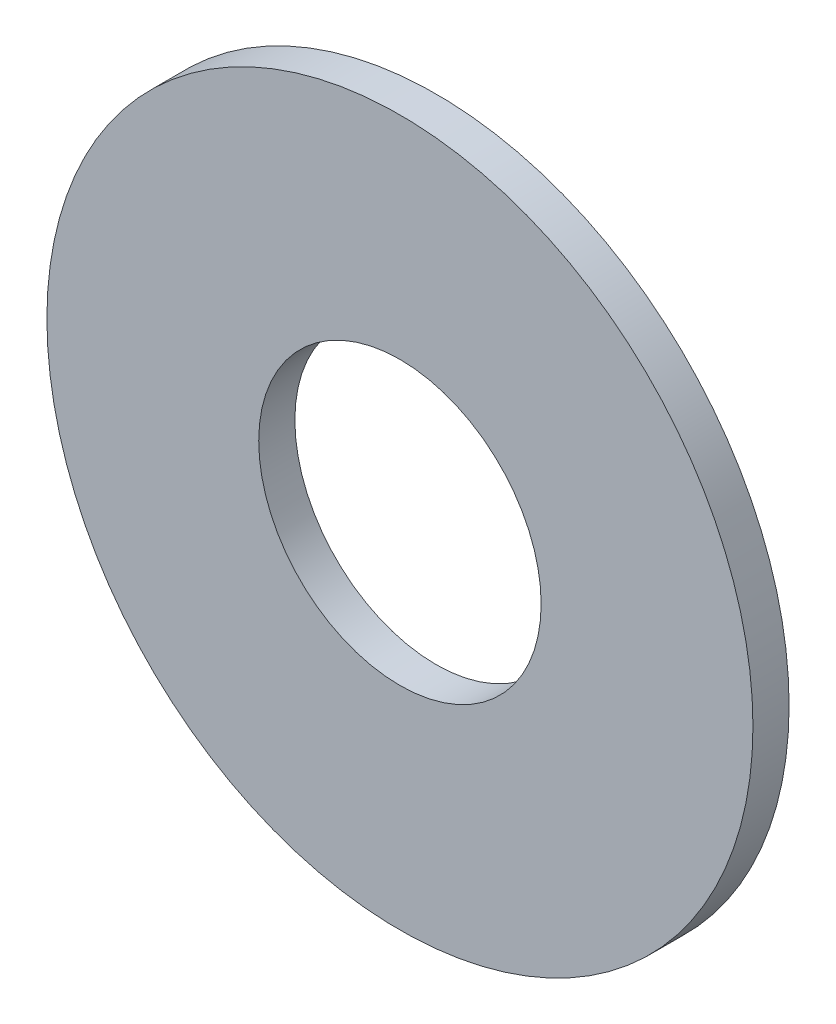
from build123d import *

# Parameters (mm, degrees)
SKETCH2_R           = 7.9375
SKETCH2_R_2         = 3.175
BOSS_EXTRUDE1_DEPTH = 0.8128


with BuildPart() as part:
    # Sketch2 → Boss-Extrude1 (new body)
    with BuildSketch(Plane.XY):
        Circle(SKETCH2_R)
        Circle(SKETCH2_R_2, mode=Mode.SUBTRACT)
    extrude(amount=BOSS_EXTRUDE1_DEPTH)


solid = part.part
